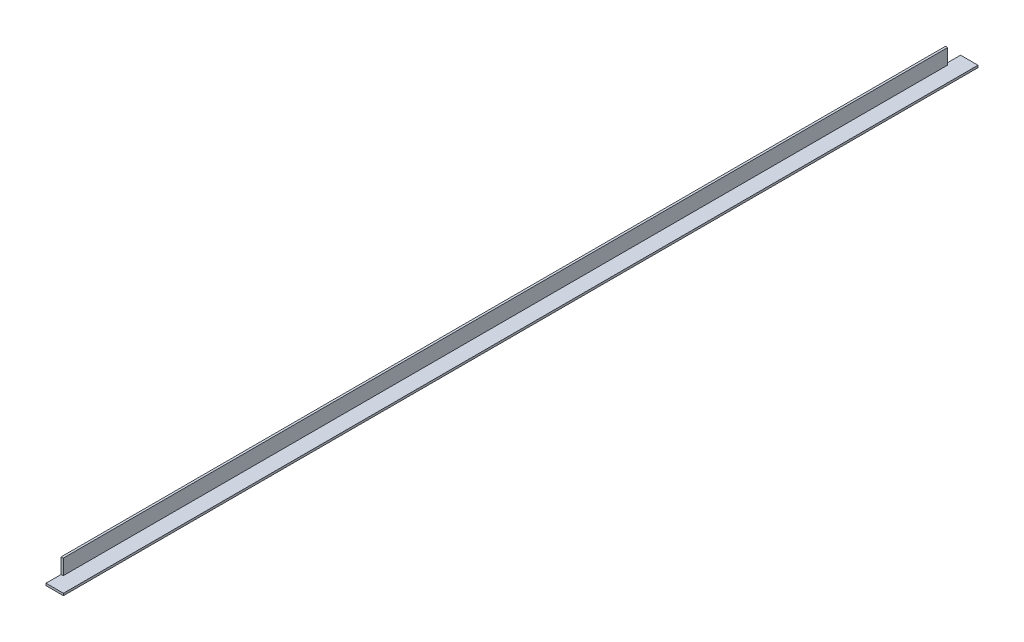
ISO-10303-21;
HEADER;
FILE_DESCRIPTION(('STEP AP214'),'2;1');
FILE_NAME('part.step','',(''),(''),'','','');
FILE_SCHEMA(('AUTOMOTIVE_DESIGN { 1 0 10303 214 1 1 1 1 }'));
ENDSEC;
DATA;
#1=APPLICATION_CONTEXT('core data for automotive mechanical design processes');
#2=APPLICATION_PROTOCOL_DEFINITION('international standard','automotive_design',2000,#1);
#3=PRODUCT_CONTEXT('',#1,'mechanical');
#4=PRODUCT('Part','Part','',(#3));
#5=PRODUCT_RELATED_PRODUCT_CATEGORY('part','',(#4));
#6=PRODUCT_DEFINITION_FORMATION('','',#4);
#7=PRODUCT_DEFINITION_CONTEXT('part definition',#1,'design');
#8=PRODUCT_DEFINITION('design','',#6,#7);
#9=PRODUCT_DEFINITION_SHAPE('','',#8);
#10=(LENGTH_UNIT() NAMED_UNIT(*) SI_UNIT(.MILLI.,.METRE.));
#11=(NAMED_UNIT(*) PLANE_ANGLE_UNIT() SI_UNIT($,.RADIAN.));
#12=(NAMED_UNIT(*) SI_UNIT($,.STERADIAN.) SOLID_ANGLE_UNIT());
#13=UNCERTAINTY_MEASURE_WITH_UNIT(LENGTH_MEASURE(1.E-05),#10,'distance_accuracy_value','');
#14=(GEOMETRIC_REPRESENTATION_CONTEXT(3) GLOBAL_UNCERTAINTY_ASSIGNED_CONTEXT((#13)) GLOBAL_UNIT_ASSIGNED_CONTEXT((#10,
#11,#12)) REPRESENTATION_CONTEXT('',''));
#15=CARTESIAN_POINT('',(0.,0.,0.));
#16=DIRECTION('',(0.,0.,1.));
#17=DIRECTION('',(1.,0.,0.));
#18=AXIS2_PLACEMENT_3D('',#15,#16,#17);
#19=CARTESIAN_POINT('',(38.1,0.,0.));
#20=DIRECTION('',(0.,0.,1.));
#21=DIRECTION('',(1.,0.,0.));
#22=AXIS2_PLACEMENT_3D('',#19,#20,#21);
#23=PLANE('',#22);
#24=DIRECTION('',(1.,0.,0.));
#25=VECTOR('',#24,1.);
#26=CARTESIAN_POINT('',(0.,4.74980000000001,0.));
#27=LINE('',#26,#25);
#28=CARTESIAN_POINT('',(0.,4.74980000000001,0.));
#29=VERTEX_POINT('',#28);
#30=CARTESIAN_POINT('',(4.7498,4.7498,0.));
#31=VERTEX_POINT('',#30);
#32=EDGE_CURVE('E146',#29,#31,#27,.T.);
#33=ORIENTED_EDGE('',*,*,#32,.F.);
#34=DIRECTION('',(0.,-1.,0.));
#35=VECTOR('',#34,1.);
#36=CARTESIAN_POINT('',(0.,0.,0.));
#37=LINE('',#36,#35);
#38=CARTESIAN_POINT('',(0.,38.1,0.));
#39=VERTEX_POINT('',#38);
#40=EDGE_CURVE('E149',#39,#29,#37,.T.);
#41=ORIENTED_EDGE('',*,*,#40,.F.);
#42=DIRECTION('',(-1.,0.,0.));
#43=VECTOR('',#42,1.);
#44=CARTESIAN_POINT('',(4.7498,38.1,0.));
#45=LINE('',#44,#43);
#46=CARTESIAN_POINT('',(4.7498,38.1,0.));
#47=VERTEX_POINT('',#46);
#48=EDGE_CURVE('E71',#47,#39,#45,.T.);
#49=ORIENTED_EDGE('',*,*,#48,.F.);
#50=DIRECTION('',(0.,1.,0.));
#51=VECTOR('',#50,1.);
#52=CARTESIAN_POINT('',(4.7498,4.7498,0.));
#53=LINE('',#52,#51);
#54=EDGE_CURVE('E66',#31,#47,#53,.T.);
#55=ORIENTED_EDGE('',*,*,#54,.F.);
#56=EDGE_LOOP('',(#33,#41,#49,#55));
#57=FACE_BOUND('',#56,.T.);
#58=ADVANCED_FACE('F32',(#57),#23,.F.);
#59=CARTESIAN_POINT('',(0.,0.,1934.21));
#60=DIRECTION('',(0.,1.,0.));
#61=DIRECTION('',(0.,0.,1.));
#62=AXIS2_PLACEMENT_3D('',#59,#60,#61);
#63=PLANE('',#62);
#64=DIRECTION('',(0.,0.,-1.));
#65=VECTOR('',#64,1.);
#66=CARTESIAN_POINT('',(0.,0.,1934.21));
#67=LINE('',#66,#65);
#68=CARTESIAN_POINT('',(0.,0.,1967.23));
#69=VERTEX_POINT('',#68);
#70=CARTESIAN_POINT('',(0.,0.,-33.02));
#71=VERTEX_POINT('',#70);
#72=EDGE_CURVE('E106',#69,#71,#67,.T.);
#73=ORIENTED_EDGE('',*,*,#72,.T.);
#74=DIRECTION('',(-1.,0.,0.));
#75=VECTOR('',#74,1.);
#76=CARTESIAN_POINT('',(38.1,0.,-33.02));
#77=LINE('',#76,#75);
#78=CARTESIAN_POINT('',(38.1,0.,-33.02));
#79=VERTEX_POINT('',#78);
#80=EDGE_CURVE('E179',#79,#71,#77,.T.);
#81=ORIENTED_EDGE('',*,*,#80,.F.);
#82=DIRECTION('',(0.,0.,-1.));
#83=VECTOR('',#82,1.);
#84=CARTESIAN_POINT('',(38.1,0.,1934.21));
#85=LINE('',#84,#83);
#86=CARTESIAN_POINT('',(38.1,0.,1967.23));
#87=VERTEX_POINT('',#86);
#88=EDGE_CURVE('E42',#87,#79,#85,.T.);
#89=ORIENTED_EDGE('',*,*,#88,.F.);
#90=DIRECTION('',(1.,0.,0.));
#91=VECTOR('',#90,1.);
#92=CARTESIAN_POINT('',(0.,0.,1967.23));
#93=LINE('',#92,#91);
#94=EDGE_CURVE('E122',#69,#87,#93,.T.);
#95=ORIENTED_EDGE('',*,*,#94,.F.);
#96=EDGE_LOOP('',(#73,#81,#89,#95));
#97=FACE_BOUND('',#96,.T.);
#98=ADVANCED_FACE('F34',(#97),#63,.F.);
#99=CARTESIAN_POINT('',(38.1,0.,1934.21));
#100=DIRECTION('',(-1.,0.,0.));
#101=DIRECTION('',(0.,0.,1.));
#102=AXIS2_PLACEMENT_3D('',#99,#100,#101);
#103=PLANE('',#102);
#104=ORIENTED_EDGE('',*,*,#88,.T.);
#105=DIRECTION('',(0.,-1.,0.));
#106=VECTOR('',#105,1.);
#107=CARTESIAN_POINT('',(38.1,4.7498,-33.02));
#108=LINE('',#107,#106);
#109=CARTESIAN_POINT('',(38.1,4.7498,-33.02));
#110=VERTEX_POINT('',#109);
#111=EDGE_CURVE('E183',#110,#79,#108,.T.);
#112=ORIENTED_EDGE('',*,*,#111,.F.);
#113=DIRECTION('',(0.,0.,-1.));
#114=VECTOR('',#113,1.);
#115=CARTESIAN_POINT('',(38.1,4.7498,1934.21));
#116=LINE('',#115,#114);
#117=CARTESIAN_POINT('',(38.1,4.7498,1967.23));
#118=VERTEX_POINT('',#117);
#119=EDGE_CURVE('E165',#118,#110,#116,.T.);
#120=ORIENTED_EDGE('',*,*,#119,.F.);
#121=DIRECTION('',(0.,1.,0.));
#122=VECTOR('',#121,1.);
#123=CARTESIAN_POINT('',(38.1,0.,1967.23));
#124=LINE('',#123,#122);
#125=EDGE_CURVE('E126',#87,#118,#124,.T.);
#126=ORIENTED_EDGE('',*,*,#125,.F.);
#127=EDGE_LOOP('',(#104,#112,#120,#126));
#128=FACE_BOUND('',#127,.T.);
#129=ADVANCED_FACE('F192',(#128),#103,.F.);
#130=CARTESIAN_POINT('',(38.1,4.7498,1934.21));
#131=DIRECTION('',(0.,-1.,0.));
#132=DIRECTION('',(1.,0.,0.));
#133=AXIS2_PLACEMENT_3D('',#130,#131,#132);
#134=PLANE('',#133);
#135=ORIENTED_EDGE('',*,*,#119,.T.);
#136=DIRECTION('',(1.,0.,0.));
#137=VECTOR('',#136,1.);
#138=CARTESIAN_POINT('',(0.,4.74980000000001,-33.02));
#139=LINE('',#138,#137);
#140=CARTESIAN_POINT('',(0.,4.74980000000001,-33.02));
#141=VERTEX_POINT('',#140);
#142=EDGE_CURVE('E139',#141,#110,#139,.T.);
#143=ORIENTED_EDGE('',*,*,#142,.F.);
#144=DIRECTION('',(0.,0.,1.));
#145=VECTOR('',#144,1.);
#146=CARTESIAN_POINT('',(0.,4.74980000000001,-33.02));
#147=LINE('',#146,#145);
#148=EDGE_CURVE('E172',#141,#29,#147,.T.);
#149=ORIENTED_EDGE('',*,*,#148,.T.);
#150=ORIENTED_EDGE('',*,*,#32,.T.);
#151=DIRECTION('',(0.,0.,-1.));
#152=VECTOR('',#151,1.);
#153=CARTESIAN_POINT('',(4.7498,4.7498,1934.21));
#154=LINE('',#153,#152);
#155=CARTESIAN_POINT('',(4.7498,4.7498,1934.21));
#156=VERTEX_POINT('',#155);
#157=EDGE_CURVE('E159',#156,#31,#154,.T.);
#158=ORIENTED_EDGE('',*,*,#157,.F.);
#159=DIRECTION('',(-1.,0.,0.));
#160=VECTOR('',#159,1.);
#161=CARTESIAN_POINT('',(38.1,4.7498,1934.21));
#162=LINE('',#161,#160);
#163=CARTESIAN_POINT('',(0.,4.74980000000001,1934.21));
#164=VERTEX_POINT('',#163);
#165=EDGE_CURVE('E11',#156,#164,#162,.T.);
#166=ORIENTED_EDGE('',*,*,#165,.T.);
#167=DIRECTION('',(0.,0.,-1.));
#168=VECTOR('',#167,1.);
#169=CARTESIAN_POINT('',(0.,4.74980000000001,1967.23));
#170=LINE('',#169,#168);
#171=CARTESIAN_POINT('',(0.,4.74980000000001,1967.23));
#172=VERTEX_POINT('',#171);
#173=EDGE_CURVE('E136',#172,#164,#170,.T.);
#174=ORIENTED_EDGE('',*,*,#173,.F.);
#175=DIRECTION('',(-1.,0.,0.));
#176=VECTOR('',#175,1.);
#177=CARTESIAN_POINT('',(38.1,4.7498,1967.23));
#178=LINE('',#177,#176);
#179=EDGE_CURVE('E130',#118,#172,#178,.T.);
#180=ORIENTED_EDGE('',*,*,#179,.F.);
#181=EDGE_LOOP('',(#135,#143,#149,#150,#158,#166,#174,#180));
#182=FACE_BOUND('',#181,.T.);
#183=ADVANCED_FACE('F193',(#182),#134,.F.);
#184=CARTESIAN_POINT('',(4.7498,4.7498,1934.21));
#185=DIRECTION('',(-1.,0.,0.));
#186=DIRECTION('',(0.,-1.,0.));
#187=AXIS2_PLACEMENT_3D('',#184,#185,#186);
#188=PLANE('',#187);
#189=ORIENTED_EDGE('',*,*,#54,.T.);
#190=DIRECTION('',(0.,0.,-1.));
#191=VECTOR('',#190,1.);
#192=CARTESIAN_POINT('',(4.7498,38.1,1934.21));
#193=LINE('',#192,#191);
#194=CARTESIAN_POINT('',(4.7498,38.1,1934.21));
#195=VERTEX_POINT('',#194);
#196=EDGE_CURVE('E164',#195,#47,#193,.T.);
#197=ORIENTED_EDGE('',*,*,#196,.F.);
#198=DIRECTION('',(0.,1.,0.));
#199=VECTOR('',#198,1.);
#200=CARTESIAN_POINT('',(4.7498,4.7498,1934.21));
#201=LINE('',#200,#199);
#202=EDGE_CURVE('E148',#156,#195,#201,.T.);
#203=ORIENTED_EDGE('',*,*,#202,.F.);
#204=ORIENTED_EDGE('',*,*,#157,.T.);
#205=EDGE_LOOP('',(#189,#197,#203,#204));
#206=FACE_BOUND('',#205,.T.);
#207=ADVANCED_FACE('F169',(#206),#188,.F.);
#208=CARTESIAN_POINT('',(4.7498,38.1,1934.21));
#209=DIRECTION('',(0.,-1.,0.));
#210=DIRECTION('',(0.,0.,-1.));
#211=AXIS2_PLACEMENT_3D('',#208,#209,#210);
#212=PLANE('',#211);
#213=ORIENTED_EDGE('',*,*,#48,.T.);
#214=DIRECTION('',(0.,0.,-1.));
#215=VECTOR('',#214,1.);
#216=CARTESIAN_POINT('',(0.,38.1,1934.21));
#217=LINE('',#216,#215);
#218=CARTESIAN_POINT('',(0.,38.1,1934.21));
#219=VERTEX_POINT('',#218);
#220=EDGE_CURVE('E118',#219,#39,#217,.T.);
#221=ORIENTED_EDGE('',*,*,#220,.F.);
#222=DIRECTION('',(-1.,0.,0.));
#223=VECTOR('',#222,1.);
#224=CARTESIAN_POINT('',(4.7498,38.1,1934.21));
#225=LINE('',#224,#223);
#226=EDGE_CURVE('E51',#195,#219,#225,.T.);
#227=ORIENTED_EDGE('',*,*,#226,.F.);
#228=ORIENTED_EDGE('',*,*,#196,.T.);
#229=EDGE_LOOP('',(#213,#221,#227,#228));
#230=FACE_BOUND('',#229,.T.);
#231=ADVANCED_FACE('F203',(#230),#212,.F.);
#232=CARTESIAN_POINT('',(0.,0.,1934.21));
#233=DIRECTION('',(1.,0.,0.));
#234=DIRECTION('',(0.,0.,-1.));
#235=AXIS2_PLACEMENT_3D('',#232,#233,#234);
#236=PLANE('',#235);
#237=ORIENTED_EDGE('',*,*,#40,.T.);
#238=ORIENTED_EDGE('',*,*,#148,.F.);
#239=DIRECTION('',(0.,1.,0.));
#240=VECTOR('',#239,1.);
#241=CARTESIAN_POINT('',(0.,0.,-33.02));
#242=LINE('',#241,#240);
#243=EDGE_CURVE('E114',#71,#141,#242,.T.);
#244=ORIENTED_EDGE('',*,*,#243,.F.);
#245=ORIENTED_EDGE('',*,*,#72,.F.);
#246=DIRECTION('',(0.,-1.,0.));
#247=VECTOR('',#246,1.);
#248=CARTESIAN_POINT('',(0.,4.74980000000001,1967.23));
#249=LINE('',#248,#247);
#250=EDGE_CURVE('E112',#172,#69,#249,.T.);
#251=ORIENTED_EDGE('',*,*,#250,.F.);
#252=ORIENTED_EDGE('',*,*,#173,.T.);
#253=DIRECTION('',(0.,-1.,0.));
#254=VECTOR('',#253,1.);
#255=CARTESIAN_POINT('',(0.,0.,1934.21));
#256=LINE('',#255,#254);
#257=EDGE_CURVE('E119',#219,#164,#256,.T.);
#258=ORIENTED_EDGE('',*,*,#257,.F.);
#259=ORIENTED_EDGE('',*,*,#220,.T.);
#260=EDGE_LOOP('',(#237,#238,#244,#245,#251,#252,#258,#259));
#261=FACE_BOUND('',#260,.T.);
#262=ADVANCED_FACE('F109',(#261),#236,.F.);
#263=CARTESIAN_POINT('',(38.1,0.,1934.21));
#264=DIRECTION('',(0.,0.,1.));
#265=DIRECTION('',(1.,0.,0.));
#266=AXIS2_PLACEMENT_3D('',#263,#264,#265);
#267=PLANE('',#266);
#268=ORIENTED_EDGE('',*,*,#165,.F.);
#269=ORIENTED_EDGE('',*,*,#202,.T.);
#270=ORIENTED_EDGE('',*,*,#226,.T.);
#271=ORIENTED_EDGE('',*,*,#257,.T.);
#272=EDGE_LOOP('',(#268,#269,#270,#271));
#273=FACE_BOUND('',#272,.T.);
#274=ADVANCED_FACE('F195',(#273),#267,.T.);
#275=CARTESIAN_POINT('',(38.1,4.7498,-33.02));
#276=DIRECTION('',(0.,0.,-1.));
#277=DIRECTION('',(-1.,0.,0.));
#278=AXIS2_PLACEMENT_3D('',#275,#276,#277);
#279=PLANE('',#278);
#280=ORIENTED_EDGE('',*,*,#142,.T.);
#281=ORIENTED_EDGE('',*,*,#111,.T.);
#282=ORIENTED_EDGE('',*,*,#80,.T.);
#283=ORIENTED_EDGE('',*,*,#243,.T.);
#284=EDGE_LOOP('',(#280,#281,#282,#283));
#285=FACE_BOUND('',#284,.T.);
#286=ADVANCED_FACE('F190',(#285),#279,.T.);
#287=CARTESIAN_POINT('',(0.,0.,1967.23));
#288=DIRECTION('',(0.,0.,1.));
#289=DIRECTION('',(1.,0.,0.));
#290=AXIS2_PLACEMENT_3D('',#287,#288,#289);
#291=PLANE('',#290);
#292=ORIENTED_EDGE('',*,*,#250,.T.);
#293=ORIENTED_EDGE('',*,*,#94,.T.);
#294=ORIENTED_EDGE('',*,*,#125,.T.);
#295=ORIENTED_EDGE('',*,*,#179,.T.);
#296=EDGE_LOOP('',(#292,#293,#294,#295));
#297=FACE_BOUND('',#296,.T.);
#298=ADVANCED_FACE('F128',(#297),#291,.T.);
#299=CLOSED_SHELL('',(#58,#98,#129,#183,#207,#231,#262,#274,#286,#298));
#300=MANIFOLD_SOLID_BREP('B2',#299);
#301=ADVANCED_BREP_SHAPE_REPRESENTATION('',(#18,#300),#14);
#302=SHAPE_DEFINITION_REPRESENTATION(#9,#301);
ENDSEC;
END-ISO-10303-21;
